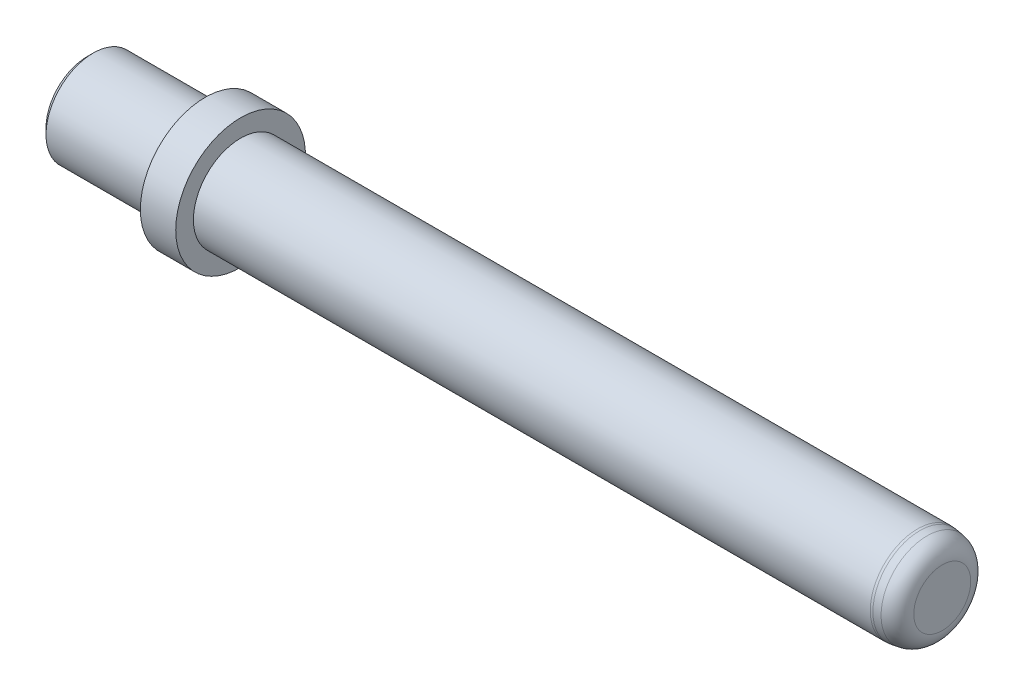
from build123d import *


with BuildPart() as part:
    # Esquisse1 → R_volution1 (revolve)
    with BuildSketch(Plane.XY, mode=Mode.PRIVATE) as r_volution1_sk:
        with BuildLine():
            Line((6.042926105, 0), (4, 3.4))
            Line((4, 3.4), (0, 3.4))
            Line((0, 3.4), (0, 4))
            Line((0, 4), (-20, 4))
            Line((-20, 4), (-20, 7))
            Line((-20, 7), (-19, 8))
            Line((-19, 8), (0, 8))
            Line((0, 8), (0, 11))
            Line((0, 11), (6, 11))
            Line((6, 11), (6, 8))
            Line((6, 8), (120.790219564, 8))
            ThreePointArc((120.790219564, 8), (120.999488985, 7.992692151), (121.207738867, 7.970804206))
            Line((121.207738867, 7.970804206), (122.417519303, 7.800780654))
            ThreePointArc((122.417519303, 7.800780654), (124.264128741, 6.798153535), (125, 4.829976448))
            Line((125, 4.829976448), (125, 0))
            Line((125, 0), (6.042926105, 0))
        make_face()
    revolve(r_volution1_sk.sketch.rotate(Axis((125, 0, 0), (-1, 0, 0)), 270), axis=Axis((125, 0, 0), (-1, 0, 0)))


solid = part.part
